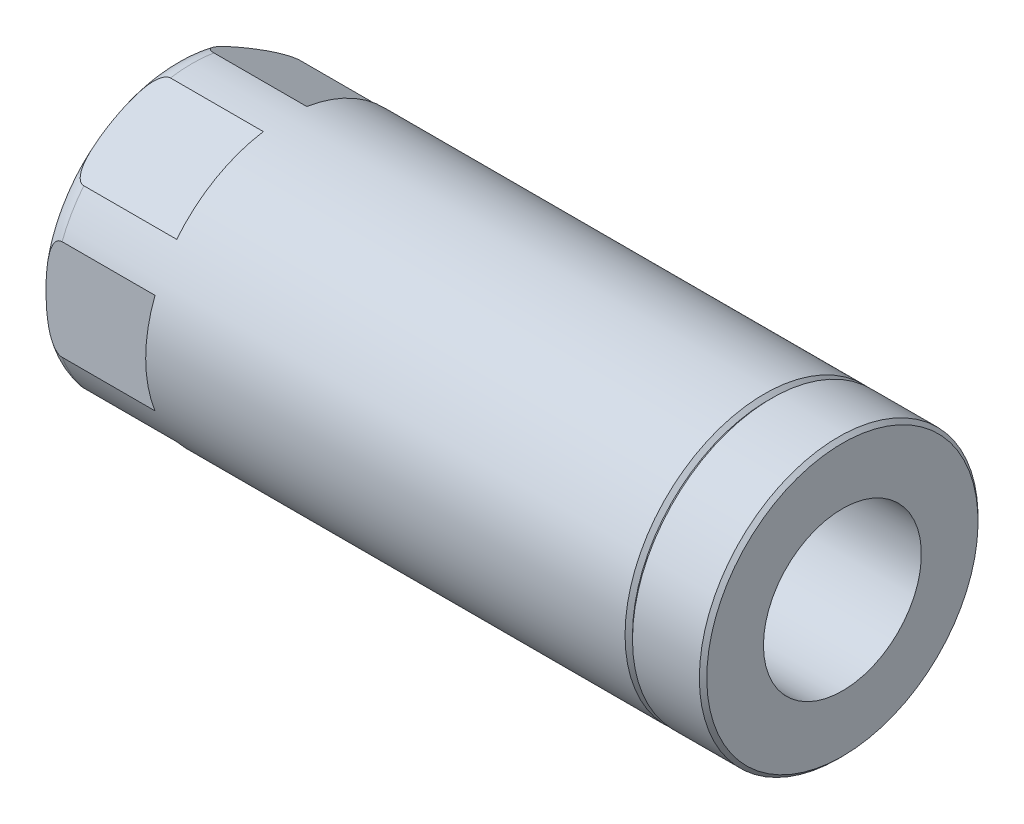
ISO-10303-21;
HEADER;
FILE_DESCRIPTION(('STEP AP214'),'2;1');
FILE_NAME('part.step','',(''),(''),'','','');
FILE_SCHEMA(('AUTOMOTIVE_DESIGN { 1 0 10303 214 1 1 1 1 }'));
ENDSEC;
DATA;
#1=APPLICATION_CONTEXT('core data for automotive mechanical design processes');
#2=APPLICATION_PROTOCOL_DEFINITION('international standard','automotive_design',2000,#1);
#3=PRODUCT_CONTEXT('',#1,'mechanical');
#4=PRODUCT('Part','Part','',(#3));
#5=PRODUCT_RELATED_PRODUCT_CATEGORY('part','',(#4));
#6=PRODUCT_DEFINITION_FORMATION('','',#4);
#7=PRODUCT_DEFINITION_CONTEXT('part definition',#1,'design');
#8=PRODUCT_DEFINITION('design','',#6,#7);
#9=PRODUCT_DEFINITION_SHAPE('','',#8);
#10=(LENGTH_UNIT() NAMED_UNIT(*) SI_UNIT(.MILLI.,.METRE.));
#11=(NAMED_UNIT(*) PLANE_ANGLE_UNIT() SI_UNIT($,.RADIAN.));
#12=(NAMED_UNIT(*) SI_UNIT($,.STERADIAN.) SOLID_ANGLE_UNIT());
#13=UNCERTAINTY_MEASURE_WITH_UNIT(LENGTH_MEASURE(1.E-05),#10,'distance_accuracy_value','');
#14=(GEOMETRIC_REPRESENTATION_CONTEXT(3) GLOBAL_UNCERTAINTY_ASSIGNED_CONTEXT((#13)) GLOBAL_UNIT_ASSIGNED_CONTEXT((#10,
#11,#12)) REPRESENTATION_CONTEXT('',''));
#15=CARTESIAN_POINT('',(0.,0.,0.));
#16=DIRECTION('',(0.,0.,1.));
#17=DIRECTION('',(1.,0.,0.));
#18=AXIS2_PLACEMENT_3D('',#15,#16,#17);
#19=CARTESIAN_POINT('',(36.,0.,0.));
#20=DIRECTION('',(-1.,0.,0.));
#21=DIRECTION('',(0.,0.,1.));
#22=AXIS2_PLACEMENT_3D('',#19,#20,#21);
#23=CYLINDRICAL_SURFACE('',#22,4.25);
#24=CARTESIAN_POINT('',(36.,0.,0.));
#25=DIRECTION('',(-1.,0.,0.));
#26=DIRECTION('',(0.,0.,1.));
#27=AXIS2_PLACEMENT_3D('',#24,#25,#26);
#28=CIRCLE('',#27,4.25);
#29=CARTESIAN_POINT('',(36.,0.,4.25));
#30=VERTEX_POINT('',#29);
#31=EDGE_CURVE('E466',#30,#30,#28,.F.);
#32=ORIENTED_EDGE('',*,*,#31,.T.);
#33=EDGE_LOOP('',(#32));
#34=FACE_BOUND('',#33,.T.);
#35=CARTESIAN_POINT('',(7.99999999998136,0.,0.));
#36=DIRECTION('',(1.,0.,0.));
#37=DIRECTION('',(0.,0.,-1.));
#38=AXIS2_PLACEMENT_3D('',#35,#36,#37);
#39=CIRCLE('',#38,4.2499999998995);
#40=CARTESIAN_POINT('',(7.99999999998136,0.,-4.2499999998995));
#41=VERTEX_POINT('',#40);
#42=EDGE_CURVE('E462',#41,#41,#39,.F.);
#43=ORIENTED_EDGE('',*,*,#42,.T.);
#44=EDGE_LOOP('',(#43));
#45=FACE_BOUND('',#44,.T.);
#46=ADVANCED_FACE('F17',(#34,#45),#23,.F.);
#47=CARTESIAN_POINT('',(36.,4.25,0.));
#48=DIRECTION('',(-1.,0.,0.));
#49=DIRECTION('',(0.,0.,1.));
#50=AXIS2_PLACEMENT_3D('',#47,#48,#49);
#51=PLANE('',#50);
#52=ORIENTED_EDGE('',*,*,#31,.F.);
#53=EDGE_LOOP('',(#52));
#54=FACE_BOUND('',#53,.T.);
#55=CARTESIAN_POINT('',(36.,0.,0.));
#56=DIRECTION('',(-1.,0.,0.));
#57=DIRECTION('',(0.,-1.,0.));
#58=AXIS2_PLACEMENT_3D('',#55,#56,#57);
#59=CIRCLE('',#58,7.3);
#60=CARTESIAN_POINT('',(36.,-7.3,0.));
#61=VERTEX_POINT('',#60);
#62=EDGE_CURVE('E465',#61,#61,#59,.T.);
#63=ORIENTED_EDGE('',*,*,#62,.F.);
#64=EDGE_LOOP('',(#63));
#65=FACE_BOUND('',#64,.T.);
#66=ADVANCED_FACE('F515',(#54,#65),#51,.F.);
#67=CARTESIAN_POINT('',(7.99999999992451,0.,0.));
#68=DIRECTION('',(1.,0.,0.));
#69=DIRECTION('',(0.,0.,-1.));
#70=AXIS2_PLACEMENT_3D('',#67,#68,#69);
#71=CONICAL_SURFACE('',#70,4.24999999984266,0.785398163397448);
#72=CARTESIAN_POINT('',(6.2085,0.,0.));
#73=DIRECTION('',(-1.,0.,0.));
#74=DIRECTION('',(0.,0.,1.));
#75=AXIS2_PLACEMENT_3D('',#72,#73,#74);
#76=CIRCLE('',#75,2.4585);
#77=CARTESIAN_POINT('',(6.2085,0.,2.4585));
#78=VERTEX_POINT('',#77);
#79=EDGE_CURVE('E467',#78,#78,#76,.T.);
#80=ORIENTED_EDGE('',*,*,#79,.T.);
#81=EDGE_LOOP('',(#80));
#82=FACE_BOUND('',#81,.T.);
#83=ORIENTED_EDGE('',*,*,#42,.F.);
#84=EDGE_LOOP('',(#83));
#85=FACE_BOUND('',#84,.T.);
#86=ADVANCED_FACE('F512',(#82,#85),#71,.F.);
#87=CARTESIAN_POINT('',(35.8,0.,0.));
#88=DIRECTION('',(-1.,0.,0.));
#89=DIRECTION('',(0.,-1.,0.));
#90=AXIS2_PLACEMENT_3D('',#87,#88,#89);
#91=CONICAL_SURFACE('',#90,7.5,0.785398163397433);
#92=CARTESIAN_POINT('',(35.8,0.,0.));
#93=DIRECTION('',(-1.,0.,0.));
#94=DIRECTION('',(0.,0.,1.));
#95=AXIS2_PLACEMENT_3D('',#92,#93,#94);
#96=CIRCLE('',#95,7.5);
#97=CARTESIAN_POINT('',(35.8,0.,7.5));
#98=VERTEX_POINT('',#97);
#99=EDGE_CURVE('E470',#98,#98,#96,.T.);
#100=ORIENTED_EDGE('',*,*,#99,.F.);
#101=EDGE_LOOP('',(#100));
#102=FACE_BOUND('',#101,.T.);
#103=ORIENTED_EDGE('',*,*,#62,.T.);
#104=EDGE_LOOP('',(#103));
#105=FACE_BOUND('',#104,.T.);
#106=ADVANCED_FACE('F508',(#102,#105),#91,.T.);
#107=CARTESIAN_POINT('',(36.,0.,0.));
#108=DIRECTION('',(-1.,0.,0.));
#109=DIRECTION('',(0.,0.,1.));
#110=AXIS2_PLACEMENT_3D('',#107,#108,#109);
#111=CYLINDRICAL_SURFACE('',#110,2.4585);
#112=ORIENTED_EDGE('',*,*,#79,.F.);
#113=EDGE_LOOP('',(#112));
#114=FACE_BOUND('',#113,.T.);
#115=CARTESIAN_POINT('',(0.541499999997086,0.,0.));
#116=DIRECTION('',(-1.,0.,0.));
#117=DIRECTION('',(0.,0.,1.));
#118=AXIS2_PLACEMENT_3D('',#115,#116,#117);
#119=CIRCLE('',#118,2.45849999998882);
#120=CARTESIAN_POINT('',(0.541499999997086,0.,2.45849999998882));
#121=VERTEX_POINT('',#120);
#122=EDGE_CURVE('E473',#121,#121,#119,.T.);
#123=ORIENTED_EDGE('',*,*,#122,.T.);
#124=EDGE_LOOP('',(#123));
#125=FACE_BOUND('',#124,.T.);
#126=ADVANCED_FACE('F501',(#114,#125),#111,.F.);
#127=CARTESIAN_POINT('',(36.,0.,0.));
#128=DIRECTION('',(-1.,0.,0.));
#129=DIRECTION('',(0.,0.,1.));
#130=AXIS2_PLACEMENT_3D('',#127,#128,#129);
#131=CYLINDRICAL_SURFACE('',#130,7.5);
#132=CARTESIAN_POINT('',(32.2,0.,0.));
#133=DIRECTION('',(1.,0.,0.));
#134=DIRECTION('',(0.,0.,-1.));
#135=AXIS2_PLACEMENT_3D('',#132,#133,#134);
#136=CIRCLE('',#135,7.5);
#137=CARTESIAN_POINT('',(32.2,0.,-7.5));
#138=VERTEX_POINT('',#137);
#139=EDGE_CURVE('E475',#138,#138,#136,.F.);
#140=ORIENTED_EDGE('',*,*,#139,.F.);
#141=EDGE_LOOP('',(#140));
#142=FACE_BOUND('',#141,.T.);
#143=ORIENTED_EDGE('',*,*,#99,.T.);
#144=EDGE_LOOP('',(#143));
#145=FACE_BOUND('',#144,.T.);
#146=ADVANCED_FACE('F496',(#142,#145),#131,.T.);
#147=CARTESIAN_POINT('',(0.,0.,0.));
#148=DIRECTION('',(-1.,0.,0.));
#149=DIRECTION('',(0.,0.,1.));
#150=AXIS2_PLACEMENT_3D('',#147,#148,#149);
#151=CONICAL_SURFACE('',#150,2.9999999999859,0.785398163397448);
#152=ORIENTED_EDGE('',*,*,#122,.F.);
#153=EDGE_LOOP('',(#152));
#154=FACE_BOUND('',#153,.T.);
#155=CARTESIAN_POINT('',(0.,0.,0.));
#156=DIRECTION('',(-1.,0.,0.));
#157=DIRECTION('',(0.,0.,1.));
#158=AXIS2_PLACEMENT_3D('',#155,#156,#157);
#159=CIRCLE('',#158,2.9999999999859);
#160=CARTESIAN_POINT('',(0.,0.,2.9999999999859));
#161=VERTEX_POINT('',#160);
#162=EDGE_CURVE('E152',#161,#161,#159,.T.);
#163=ORIENTED_EDGE('',*,*,#162,.T.);
#164=EDGE_LOOP('',(#163));
#165=FACE_BOUND('',#164,.T.);
#166=ADVANCED_FACE('F492',(#154,#165),#151,.F.);
#167=CARTESIAN_POINT('',(32.2,0.,0.));
#168=DIRECTION('',(1.,0.,0.));
#169=DIRECTION('',(0.,0.,-1.));
#170=AXIS2_PLACEMENT_3D('',#167,#168,#169);
#171=CONICAL_SURFACE('',#170,7.5,0.785398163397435);
#172=ORIENTED_EDGE('',*,*,#139,.T.);
#173=EDGE_LOOP('',(#172));
#174=FACE_BOUND('',#173,.T.);
#175=CARTESIAN_POINT('',(32.,0.,0.));
#176=DIRECTION('',(-1.,0.,0.));
#177=DIRECTION('',(0.,0.,1.));
#178=AXIS2_PLACEMENT_3D('',#175,#176,#177);
#179=CIRCLE('',#178,7.3);
#180=CARTESIAN_POINT('',(32.,0.,7.3));
#181=VERTEX_POINT('',#180);
#182=EDGE_CURVE('E203',#181,#181,#179,.T.);
#183=ORIENTED_EDGE('',*,*,#182,.F.);
#184=EDGE_LOOP('',(#183));
#185=FACE_BOUND('',#184,.T.);
#186=ADVANCED_FACE('F185',(#174,#185),#171,.T.);
#187=CARTESIAN_POINT('',(0.,6.5,0.));
#188=DIRECTION('',(1.,0.,0.));
#189=DIRECTION('',(0.,0.,-1.));
#190=AXIS2_PLACEMENT_3D('',#187,#188,#189);
#191=PLANE('',#190);
#192=CARTESIAN_POINT('',(0.,0.,0.));
#193=DIRECTION('',(1.,0.,0.));
#194=DIRECTION('',(0.,0.,1.));
#195=AXIS2_PLACEMENT_3D('',#192,#193,#194);
#196=CIRCLE('',#195,6.5);
#197=CARTESIAN_POINT('',(0.,0.,6.5));
#198=VERTEX_POINT('',#197);
#199=CARTESIAN_POINT('',(0.,0.,-6.5));
#200=VERTEX_POINT('',#199);
#201=EDGE_CURVE('E167',#198,#200,#196,.T.);
#202=ORIENTED_EDGE('',*,*,#201,.F.);
#203=CARTESIAN_POINT('',(0.,0.,0.));
#204=DIRECTION('',(1.,0.,0.));
#205=DIRECTION('',(0.,0.,-1.));
#206=AXIS2_PLACEMENT_3D('',#203,#204,#205);
#207=CIRCLE('',#206,6.5);
#208=EDGE_CURVE('E199',#200,#198,#207,.T.);
#209=ORIENTED_EDGE('',*,*,#208,.F.);
#210=EDGE_LOOP('',(#202,#209));
#211=FACE_BOUND('',#210,.T.);
#212=ORIENTED_EDGE('',*,*,#162,.F.);
#213=EDGE_LOOP('',(#212));
#214=FACE_BOUND('',#213,.T.);
#215=ADVANCED_FACE('F174',(#211,#214),#191,.F.);
#216=CARTESIAN_POINT('',(6.,0.,0.));
#217=DIRECTION('',(1.,0.,0.));
#218=DIRECTION('',(0.,0.,-1.));
#219=AXIS2_PLACEMENT_3D('',#216,#217,#218);
#220=PLANE('',#219);
#221=CARTESIAN_POINT('',(6.,0.,0.));
#222=DIRECTION('',(-1.,0.,0.));
#223=DIRECTION('',(0.,0.,1.));
#224=AXIS2_PLACEMENT_3D('',#221,#222,#223);
#225=CIRCLE('',#224,7.5);
#226=CARTESIAN_POINT('',(6.,-4.71588662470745,5.8318447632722));
#227=VERTEX_POINT('',#226);
#228=CARTESIAN_POINT('',(6.,-7.4084690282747,1.16815523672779));
#229=VERTEX_POINT('',#228);
#230=EDGE_CURVE('E150',#227,#229,#225,.F.);
#231=ORIENTED_EDGE('',*,*,#230,.F.);
#232=DIRECTION('',(0.,0.5,0.866025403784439));
#233=VECTOR('',#232,1.);
#234=CARTESIAN_POINT('',(6.,-4.04145188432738,7.));
#235=LINE('',#234,#233);
#236=EDGE_CURVE('E143',#227,#229,#235,.F.);
#237=ORIENTED_EDGE('',*,*,#236,.T.);
#238=EDGE_LOOP('',(#231,#237));
#239=FACE_BOUND('',#238,.T.);
#240=ADVANCED_FACE('F184',(#239),#220,.F.);
#241=CARTESIAN_POINT('',(6.,-4.04145188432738,7.));
#242=DIRECTION('',(0.,0.866025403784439,-0.5));
#243=DIRECTION('',(0.,0.5,0.866025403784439));
#244=AXIS2_PLACEMENT_3D('',#241,#242,#243);
#245=PLANE('',#244);
#246=DIRECTION('',(-1.,0.,0.));
#247=VECTOR('',#246,1.);
#248=CARTESIAN_POINT('',(36.,-4.71588662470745,5.8318447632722));
#249=LINE('',#248,#247);
#250=CARTESIAN_POINT('',(1.,-4.71588662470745,5.8318447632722));
#251=VERTEX_POINT('',#250);
#252=EDGE_CURVE('E153',#251,#227,#249,.F.);
#253=ORIENTED_EDGE('',*,*,#252,.F.);
#254=CARTESIAN_POINT('',(1.00000000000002,-7.4084690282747,1.1681552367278));
#255=CARTESIAN_POINT('',(0.988799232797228,-7.40847068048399,1.16815237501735));
#256=CARTESIAN_POINT('',(0.977604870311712,-7.40820674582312,1.16860952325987));
#257=CARTESIAN_POINT('',(0.955324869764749,-7.40716421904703,1.17041523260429));
#258=CARTESIAN_POINT('',(0.944239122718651,-7.40638621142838,1.17176278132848));
#259=CARTESIAN_POINT('',(0.911519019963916,-7.40332998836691,1.1770563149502));
#260=CARTESIAN_POINT('',(0.890144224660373,-7.40032867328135,1.18225474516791));
#261=CARTESIAN_POINT('',(0.844142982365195,-7.39182550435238,1.19698266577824));
#262=CARTESIAN_POINT('',(0.819820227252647,-7.38592181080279,1.20720816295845));
#263=CARTESIAN_POINT('',(0.773333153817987,-7.3722144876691,1.23094994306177));
#264=CARTESIAN_POINT('',(0.751179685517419,-7.36440192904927,1.24448169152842));
#265=CARTESIAN_POINT('',(0.697078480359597,-7.34254059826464,1.28234662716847));
#266=CARTESIAN_POINT('',(0.666781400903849,-7.32748167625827,1.30842944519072));
#267=CARTESIAN_POINT('',(0.610957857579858,-7.29533035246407,1.36411717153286));
#268=CARTESIAN_POINT('',(0.585440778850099,-7.27823405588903,1.39372882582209));
#269=CARTESIAN_POINT('',(0.538470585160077,-7.24289259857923,1.4549420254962));
#270=CARTESIAN_POINT('',(0.516990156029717,-7.2246563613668,1.48652811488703));
#271=CARTESIAN_POINT('',(0.477148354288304,-7.18734173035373,1.55115895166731));
#272=CARTESIAN_POINT('',(0.458790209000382,-7.16826249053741,1.5842051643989));
#273=CARTESIAN_POINT('',(0.424624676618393,-7.12949680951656,1.6513492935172));
#274=CARTESIAN_POINT('',(0.40882310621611,-7.10980910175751,1.68544940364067));
#275=CARTESIAN_POINT('',(0.379405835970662,-7.0700456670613,1.75432169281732));
#276=CARTESIAN_POINT('',(0.36578907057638,-7.04997013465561,1.78909353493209));
#277=CARTESIAN_POINT('',(0.324670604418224,-6.98453529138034,1.902430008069));
#278=CARTESIAN_POINT('',(0.300816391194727,-6.93860314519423,1.98198681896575));
#279=CARTESIAN_POINT('',(0.259589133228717,-6.845959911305,2.14244960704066));
#280=CARTESIAN_POINT('',(0.24222958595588,-6.79924740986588,2.22335803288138));
#281=CARTESIAN_POINT('',(0.212395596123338,-6.70539133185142,2.38592152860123));
#282=CARTESIAN_POINT('',(0.199926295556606,-6.65824735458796,2.46757729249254));
#283=CARTESIAN_POINT('',(0.17872182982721,-6.56348745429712,2.63170625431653));
#284=CARTESIAN_POINT('',(0.170008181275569,-6.51587037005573,2.71418146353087));
#285=CARTESIAN_POINT('',(0.15566147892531,-6.42058538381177,2.87921990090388));
#286=CARTESIAN_POINT('',(0.1500244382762,-6.37291762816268,2.96178287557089));
#287=CARTESIAN_POINT('',(0.141329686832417,-6.27754207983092,3.12697817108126));
#288=CARTESIAN_POINT('',(0.138271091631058,-6.22983430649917,3.20961045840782));
#289=CARTESIAN_POINT('',(0.133508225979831,-6.11091781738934,3.41557985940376));
#290=CARTESIAN_POINT('',(0.133210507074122,-6.03969415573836,3.53894286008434));
#291=CARTESIAN_POINT('',(0.137644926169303,-5.89724505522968,3.78567193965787));
#292=CARTESIAN_POINT('',(0.142380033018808,-5.82601964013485,3.9090379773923));
#293=CARTESIAN_POINT('',(0.157756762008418,-5.68414906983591,4.15476501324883));
#294=CARTESIAN_POINT('',(0.16836197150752,-5.61350303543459,4.27712753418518));
#295=CARTESIAN_POINT('',(0.190248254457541,-5.50786686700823,4.46009474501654));
#296=CARTESIAN_POINT('',(0.198536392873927,-5.47272177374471,4.52096783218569));
#297=CARTESIAN_POINT('',(0.217527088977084,-5.40259597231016,4.64242928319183));
#298=CARTESIAN_POINT('',(0.228229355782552,-5.36761524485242,4.70301768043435));
#299=CARTESIAN_POINT('',(0.253385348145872,-5.29561289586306,4.82772940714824));
#300=CARTESIAN_POINT('',(0.268039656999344,-5.25860851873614,4.89182286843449));
#301=CARTESIAN_POINT('',(0.301641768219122,-5.18495954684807,5.01938662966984));
#302=CARTESIAN_POINT('',(0.32060198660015,-5.14831631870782,5.08285456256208));
#303=CARTESIAN_POINT('',(0.354983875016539,-5.09103788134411,5.18206372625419));
#304=CARTESIAN_POINT('',(0.368561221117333,-5.0701264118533,5.21828345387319));
#305=CARTESIAN_POINT('',(0.397951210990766,-5.02870248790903,5.29003179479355));
#306=CARTESIAN_POINT('',(0.413763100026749,-5.00818990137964,5.3255606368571));
#307=CARTESIAN_POINT('',(0.447998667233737,-4.96781298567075,5.39549550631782));
#308=CARTESIAN_POINT('',(0.466411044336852,-4.9479462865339,5.42990563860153));
#309=CARTESIAN_POINT('',(0.506482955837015,-4.90902856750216,5.49731310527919));
#310=CARTESIAN_POINT('',(0.528142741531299,-4.88997761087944,5.53031033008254));
#311=CARTESIAN_POINT('',(0.569797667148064,-4.85755467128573,5.58646850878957));
#312=CARTESIAN_POINT('',(0.588950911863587,-4.84391461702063,5.61009377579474));
#313=CARTESIAN_POINT('',(0.629959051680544,-4.81770589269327,5.65548861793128));
#314=CARTESIAN_POINT('',(0.651809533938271,-4.80513552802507,5.67726112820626));
#315=CARTESIAN_POINT('',(0.698984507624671,-4.78136907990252,5.71842582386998));
#316=CARTESIAN_POINT('',(0.724352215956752,-4.77019401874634,5.7377815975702));
#317=CARTESIAN_POINT('',(0.778629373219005,-4.75023628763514,5.77234940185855));
#318=CARTESIAN_POINT('',(0.807527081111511,-4.74144598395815,5.78757465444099));
#319=CARTESIAN_POINT('',(0.857771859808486,-4.72981901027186,5.80771316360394));
#320=CARTESIAN_POINT('',(0.878185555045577,-4.72597601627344,5.81436942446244));
#321=CARTESIAN_POINT('',(0.919994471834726,-4.72004816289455,5.82463676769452));
#322=CARTESIAN_POINT('',(0.941386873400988,-4.71795855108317,5.8282560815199));
#323=CARTESIAN_POINT('',(0.969106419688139,-4.71652468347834,5.8307396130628));
#324=CARTESIAN_POINT('',(0.975276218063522,-4.71628564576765,5.83115363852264));
#325=CARTESIAN_POINT('',(0.987629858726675,-4.71596676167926,5.83170596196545));
#326=CARTESIAN_POINT('',(0.993813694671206,-4.71588685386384,5.83184436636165));
#327=CARTESIAN_POINT('',(0.999999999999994,-4.71588662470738,5.83184476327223));
#328=B_SPLINE_CURVE_WITH_KNOTS('',3,(#254,#255,#256,#257,#258,#259,#260,#261,#262,#263,#264,
#265,#266,#267,#268,#269,#270,#271,#272,#273,#274,#275,#276,#277,#278,#279,#280,#281,#282,#283,
#284,#285,#286,#287,#288,#289,#290,#291,#292,#293,#294,#295,#296,#297,#298,#299,#300,#301,#302,
#303,#304,#305,#306,#307,#308,#309,#310,#311,#312,#313,#314,#315,#316,#317,#318,#319,#320,#321,
#322,#323,#324,#325,#326,#327),.UNSPECIFIED.,.F.,.F.,(4,2,2,2,2,2,2,2,2,2,2,2,2,2,2,2,2,2,2,2,2,
2,2,2,2,2,2,2,2,2,2,2,2,2,2,2,4),(0.,0.0335780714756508,0.067118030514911,0.133377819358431,
0.214046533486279,0.295100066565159,0.422540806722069,0.550229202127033,0.677019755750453,
0.803940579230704,0.931146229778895,1.05828965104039,1.34262726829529,1.62755256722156,
1.91277666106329,2.19961379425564,2.48607833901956,2.77244458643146,3.19969305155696,
3.62719368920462,4.05207175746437,4.26437145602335,4.47664558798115,4.70289408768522,
4.9298034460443,5.06166900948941,5.19349014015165,5.32475509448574,5.4560302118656,
5.55589257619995,5.6555936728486,5.75665111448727,5.85738114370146,5.92257044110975,
5.98758247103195,6.00614159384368,6.02469354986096),.UNSPECIFIED.);
#329=CARTESIAN_POINT('',(1.00000000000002,-7.4084690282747,1.16815523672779));
#330=VERTEX_POINT('',#329);
#331=EDGE_CURVE('E120',#330,#251,#328,.T.);
#332=ORIENTED_EDGE('',*,*,#331,.F.);
#333=DIRECTION('',(-1.,0.,0.));
#334=VECTOR('',#333,1.);
#335=CARTESIAN_POINT('',(36.,-7.4084690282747,1.16815523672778));
#336=LINE('',#335,#334);
#337=EDGE_CURVE('E147',#229,#330,#336,.T.);
#338=ORIENTED_EDGE('',*,*,#337,.F.);
#339=ORIENTED_EDGE('',*,*,#236,.F.);
#340=EDGE_LOOP('',(#253,#332,#338,#339));
#341=FACE_BOUND('',#340,.T.);
#342=ADVANCED_FACE('F317',(#341),#245,.F.);
#343=CARTESIAN_POINT('',(6.,0.,0.));
#344=DIRECTION('',(1.,0.,0.));
#345=DIRECTION('',(0.,0.,-1.));
#346=AXIS2_PLACEMENT_3D('',#343,#344,#345);
#347=PLANE('',#346);
#348=CARTESIAN_POINT('',(6.,0.,0.));
#349=DIRECTION('',(-1.,0.,0.));
#350=DIRECTION('',(0.,0.,1.));
#351=AXIS2_PLACEMENT_3D('',#348,#349,#350);
#352=CIRCLE('',#351,7.5);
#353=CARTESIAN_POINT('',(6.,-7.4084690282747,-1.1681552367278));
#354=VERTEX_POINT('',#353);
#355=CARTESIAN_POINT('',(6.,-4.71588662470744,-5.8318447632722));
#356=VERTEX_POINT('',#355);
#357=EDGE_CURVE('E136',#354,#356,#352,.F.);
#358=ORIENTED_EDGE('',*,*,#357,.F.);
#359=DIRECTION('',(0.,-0.5,0.866025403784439));
#360=VECTOR('',#359,1.);
#361=CARTESIAN_POINT('',(6.,-8.08290376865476,0.));
#362=LINE('',#361,#360);
#363=EDGE_CURVE('E121',#354,#356,#362,.F.);
#364=ORIENTED_EDGE('',*,*,#363,.T.);
#365=EDGE_LOOP('',(#358,#364));
#366=FACE_BOUND('',#365,.T.);
#367=ADVANCED_FACE('F325',(#366),#347,.F.);
#368=CARTESIAN_POINT('',(6.,-8.08290376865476,0.));
#369=DIRECTION('',(0.,0.866025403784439,0.5));
#370=DIRECTION('',(0.,-0.5,0.866025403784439));
#371=AXIS2_PLACEMENT_3D('',#368,#369,#370);
#372=PLANE('',#371);
#373=DIRECTION('',(-1.,0.,0.));
#374=VECTOR('',#373,1.);
#375=CARTESIAN_POINT('',(36.,-7.40846902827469,-1.1681552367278));
#376=LINE('',#375,#374);
#377=CARTESIAN_POINT('',(1.00000000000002,-7.4084690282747,-1.1681552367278));
#378=VERTEX_POINT('',#377);
#379=EDGE_CURVE('E116',#378,#354,#376,.F.);
#380=ORIENTED_EDGE('',*,*,#379,.F.);
#381=CARTESIAN_POINT('',(1.00000000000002,-4.71588662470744,-5.8318447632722));
#382=CARTESIAN_POINT('',(0.988799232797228,-4.71588497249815,-5.83184762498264));
#383=CARTESIAN_POINT('',(0.977604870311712,-4.71614890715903,-5.83139047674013));
#384=CARTESIAN_POINT('',(0.955324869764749,-4.71719143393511,-5.82958476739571));
#385=CARTESIAN_POINT('',(0.94423912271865,-4.71796944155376,-5.82823721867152));
#386=CARTESIAN_POINT('',(0.911519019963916,-4.72102566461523,-5.8229436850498));
#387=CARTESIAN_POINT('',(0.890144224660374,-4.72402697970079,-5.81774525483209));
#388=CARTESIAN_POINT('',(0.844142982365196,-4.73253014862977,-5.80301733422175));
#389=CARTESIAN_POINT('',(0.819820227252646,-4.73843384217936,-5.79279183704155));
#390=CARTESIAN_POINT('',(0.773333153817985,-4.75214116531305,-5.76905005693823));
#391=CARTESIAN_POINT('',(0.751179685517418,-4.75995372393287,-5.75551830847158));
#392=CARTESIAN_POINT('',(0.697078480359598,-4.7818150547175,-5.71765337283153));
#393=CARTESIAN_POINT('',(0.666781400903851,-4.79687397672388,-5.69157055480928));
#394=CARTESIAN_POINT('',(0.610957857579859,-4.82902530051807,-5.63588282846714));
#395=CARTESIAN_POINT('',(0.585440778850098,-4.8461215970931,-5.6062711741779));
#396=CARTESIAN_POINT('',(0.538470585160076,-4.88146305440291,-5.5450579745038));
#397=CARTESIAN_POINT('',(0.516990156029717,-4.89969929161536,-5.51347188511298));
#398=CARTESIAN_POINT('',(0.477148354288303,-4.9370139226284,-5.44884104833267));
#399=CARTESIAN_POINT('',(0.45879020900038,-4.95609316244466,-5.41579483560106));
#400=CARTESIAN_POINT('',(0.42462467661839,-4.99485884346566,-5.34865070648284));
#401=CARTESIAN_POINT('',(0.408823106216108,-5.01454655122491,-5.31455059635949));
#402=CARTESIAN_POINT('',(0.379405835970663,-5.05430998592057,-5.24567830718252));
#403=CARTESIAN_POINT('',(0.365789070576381,-5.07438551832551,-5.21090646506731));
#404=CARTESIAN_POINT('',(0.324670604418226,-5.13982036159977,-5.09756999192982));
#405=CARTESIAN_POINT('',(0.300816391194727,-5.18575250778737,-5.01801318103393));
#406=CARTESIAN_POINT('',(0.259589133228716,-5.2783957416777,-4.85755039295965));
#407=CARTESIAN_POINT('',(0.242229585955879,-5.32510824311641,-4.77664196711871));
#408=CARTESIAN_POINT('',(0.212395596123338,-5.41896432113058,-4.61407847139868));
#409=CARTESIAN_POINT('',(0.199926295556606,-5.46610829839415,-4.53242270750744));
#410=CARTESIAN_POINT('',(0.17872182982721,-5.56086819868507,-4.36829374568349));
#411=CARTESIAN_POINT('',(0.170008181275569,-5.60848528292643,-4.28581853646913));
#412=CARTESIAN_POINT('',(0.15566147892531,-5.70377026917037,-4.12078009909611));
#413=CARTESIAN_POINT('',(0.1500244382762,-5.75143802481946,-4.0382171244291));
#414=CARTESIAN_POINT('',(0.141329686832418,-5.84681357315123,-3.87302182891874));
#415=CARTESIAN_POINT('',(0.138271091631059,-5.89452134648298,-3.79038954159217));
#416=CARTESIAN_POINT('',(0.133508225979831,-6.01343783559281,-3.58442014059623));
#417=CARTESIAN_POINT('',(0.133210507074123,-6.08466149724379,-3.46105713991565));
#418=CARTESIAN_POINT('',(0.137644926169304,-6.22711059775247,-3.21432806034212));
#419=CARTESIAN_POINT('',(0.14238003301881,-6.2983360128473,-3.09096202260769));
#420=CARTESIAN_POINT('',(0.157756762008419,-6.44020658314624,-2.84523498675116));
#421=CARTESIAN_POINT('',(0.168361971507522,-6.51085261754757,-2.7228724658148));
#422=CARTESIAN_POINT('',(0.190248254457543,-6.61648878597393,-2.53990525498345));
#423=CARTESIAN_POINT('',(0.19853639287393,-6.65163387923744,-2.47903216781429));
#424=CARTESIAN_POINT('',(0.217527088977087,-6.721759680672,-2.35757071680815));
#425=CARTESIAN_POINT('',(0.228229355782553,-6.75674040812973,-2.29698231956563));
#426=CARTESIAN_POINT('',(0.253385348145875,-6.8287427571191,-2.17227059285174));
#427=CARTESIAN_POINT('',(0.268039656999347,-6.86574713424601,-2.1081771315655));
#428=CARTESIAN_POINT('',(0.301641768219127,-6.93939610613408,-1.98061337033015));
#429=CARTESIAN_POINT('',(0.320601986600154,-6.97603933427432,-1.9171454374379));
#430=CARTESIAN_POINT('',(0.354983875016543,-7.03331777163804,-1.8179362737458));
#431=CARTESIAN_POINT('',(0.368561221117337,-7.05422924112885,-1.78171654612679));
#432=CARTESIAN_POINT('',(0.39795121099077,-7.09565316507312,-1.70996820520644));
#433=CARTESIAN_POINT('',(0.413763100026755,-7.11616575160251,-1.6744393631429));
#434=CARTESIAN_POINT('',(0.447998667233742,-7.1565426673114,-1.60450449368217));
#435=CARTESIAN_POINT('',(0.466411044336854,-7.17640936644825,-1.57009436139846));
#436=CARTESIAN_POINT('',(0.506482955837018,-7.21532708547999,-1.5026868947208));
#437=CARTESIAN_POINT('',(0.528142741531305,-7.2343780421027,-1.46968966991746));
#438=CARTESIAN_POINT('',(0.569797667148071,-7.26680098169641,-1.41353149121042));
#439=CARTESIAN_POINT('',(0.588950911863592,-7.28044103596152,-1.38990622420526));
#440=CARTESIAN_POINT('',(0.629959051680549,-7.30664976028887,-1.34451138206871));
#441=CARTESIAN_POINT('',(0.651809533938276,-7.31922012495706,-1.32273887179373));
#442=CARTESIAN_POINT('',(0.698984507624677,-7.34298657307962,-1.28157417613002));
#443=CARTESIAN_POINT('',(0.724352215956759,-7.35416163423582,-1.26221840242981));
#444=CARTESIAN_POINT('',(0.778629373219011,-7.37411936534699,-1.22765059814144));
#445=CARTESIAN_POINT('',(0.807527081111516,-7.38290966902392,-1.21242534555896));
#446=CARTESIAN_POINT('',(0.857771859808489,-7.39453664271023,-1.19228683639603));
#447=CARTESIAN_POINT('',(0.87818555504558,-7.3983796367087,-1.18563057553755));
#448=CARTESIAN_POINT('',(0.919994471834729,-7.40430749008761,-1.17536323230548));
#449=CARTESIAN_POINT('',(0.941386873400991,-7.40639710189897,-1.17174391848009));
#450=CARTESIAN_POINT('',(0.969106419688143,-7.4078309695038,-1.1692603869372));
#451=CARTESIAN_POINT('',(0.975276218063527,-7.4080700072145,-1.16884636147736));
#452=CARTESIAN_POINT('',(0.987629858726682,-7.40838889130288,-1.16829403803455));
#453=CARTESIAN_POINT('',(0.993813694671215,-7.40846879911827,-1.16815563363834));
#454=CARTESIAN_POINT('',(1.,-7.40846902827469,-1.16815523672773));
#455=B_SPLINE_CURVE_WITH_KNOTS('',3,(#381,#382,#383,#384,#385,#386,#387,#388,#389,#390,#391,
#392,#393,#394,#395,#396,#397,#398,#399,#400,#401,#402,#403,#404,#405,#406,#407,#408,#409,#410,
#411,#412,#413,#414,#415,#416,#417,#418,#419,#420,#421,#422,#423,#424,#425,#426,#427,#428,#429,
#430,#431,#432,#433,#434,#435,#436,#437,#438,#439,#440,#441,#442,#443,#444,#445,#446,#447,#448,
#449,#450,#451,#452,#453,#454),.UNSPECIFIED.,.F.,.F.,(4,2,2,2,2,2,2,2,2,2,2,2,2,2,2,2,2,2,2,2,2,
2,2,2,2,2,2,2,2,2,2,2,2,2,2,2,4),(0.,0.0335780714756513,0.0671180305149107,0.133377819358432,
0.21404653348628,0.295100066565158,0.422540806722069,0.550229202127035,0.677019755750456,
0.803940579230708,0.931146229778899,1.05828965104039,1.34262726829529,1.62755256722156,
1.9127766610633,2.19961379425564,2.48607833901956,2.77244458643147,3.19969305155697,
3.62719368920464,4.05207175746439,4.26437145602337,4.47664558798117,4.70289408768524,
4.92980344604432,5.06166900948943,5.19349014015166,5.32475509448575,5.4560302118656,
5.55589257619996,5.65559367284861,5.75665111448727,5.85738114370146,5.92257044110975,
5.98758247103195,6.00614159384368,6.02469354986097),.UNSPECIFIED.);
#456=CARTESIAN_POINT('',(1.00000000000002,-4.71588662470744,-5.8318447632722));
#457=VERTEX_POINT('',#456);
#458=EDGE_CURVE('E109',#457,#378,#455,.T.);
#459=ORIENTED_EDGE('',*,*,#458,.F.);
#460=DIRECTION('',(-1.,0.,0.));
#461=VECTOR('',#460,1.);
#462=CARTESIAN_POINT('',(36.,-4.71588662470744,-5.83184476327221));
#463=LINE('',#462,#461);
#464=EDGE_CURVE('E113',#356,#457,#463,.T.);
#465=ORIENTED_EDGE('',*,*,#464,.F.);
#466=ORIENTED_EDGE('',*,*,#363,.F.);
#467=EDGE_LOOP('',(#380,#459,#465,#466));
#468=FACE_BOUND('',#467,.T.);
#469=ADVANCED_FACE('F111',(#468),#372,.F.);
#470=CARTESIAN_POINT('',(31.8,0.,0.));
#471=DIRECTION('',(-1.,0.,0.));
#472=DIRECTION('',(0.,0.,1.));
#473=AXIS2_PLACEMENT_3D('',#470,#471,#472);
#474=CONICAL_SURFACE('',#473,7.5,0.785398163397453);
#475=CARTESIAN_POINT('',(31.8,0.,0.));
#476=DIRECTION('',(-1.,0.,0.));
#477=DIRECTION('',(0.,0.,1.));
#478=AXIS2_PLACEMENT_3D('',#475,#476,#477);
#479=CIRCLE('',#478,7.5);
#480=CARTESIAN_POINT('',(31.8,0.,7.5));
#481=VERTEX_POINT('',#480);
#482=EDGE_CURVE('E259',#481,#481,#479,.T.);
#483=ORIENTED_EDGE('',*,*,#482,.F.);
#484=EDGE_LOOP('',(#483));
#485=FACE_BOUND('',#484,.T.);
#486=ORIENTED_EDGE('',*,*,#182,.T.);
#487=EDGE_LOOP('',(#486));
#488=FACE_BOUND('',#487,.T.);
#489=ADVANCED_FACE('F321',(#485,#488),#474,.T.);
#490=CARTESIAN_POINT('',(6.,0.,0.));
#491=DIRECTION('',(1.,0.,0.));
#492=DIRECTION('',(0.,0.,-1.));
#493=AXIS2_PLACEMENT_3D('',#490,#491,#492);
#494=PLANE('',#493);
#495=CARTESIAN_POINT('',(6.,0.,0.));
#496=DIRECTION('',(-1.,0.,0.));
#497=DIRECTION('',(0.,0.,1.));
#498=AXIS2_PLACEMENT_3D('',#495,#496,#497);
#499=CIRCLE('',#498,7.5);
#500=CARTESIAN_POINT('',(6.,-2.69258240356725,-7.));
#501=VERTEX_POINT('',#500);
#502=CARTESIAN_POINT('',(6.,2.69258240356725,-7.));
#503=VERTEX_POINT('',#502);
#504=EDGE_CURVE('E257',#501,#503,#499,.F.);
#505=ORIENTED_EDGE('',*,*,#504,.F.);
#506=DIRECTION('',(0.,1.,0.));
#507=VECTOR('',#506,1.);
#508=CARTESIAN_POINT('',(6.,-4.04145188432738,-7.));
#509=LINE('',#508,#507);
#510=EDGE_CURVE('E247',#501,#503,#509,.T.);
#511=ORIENTED_EDGE('',*,*,#510,.T.);
#512=EDGE_LOOP('',(#505,#511));
#513=FACE_BOUND('',#512,.T.);
#514=ADVANCED_FACE('F268',(#513),#494,.F.);
#515=CARTESIAN_POINT('',(6.,-4.04145188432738,-7.));
#516=DIRECTION('',(0.,0.,1.));
#517=DIRECTION('',(1.,0.,0.));
#518=AXIS2_PLACEMENT_3D('',#515,#516,#517);
#519=PLANE('',#518);
#520=DIRECTION('',(-1.,0.,0.));
#521=VECTOR('',#520,1.);
#522=CARTESIAN_POINT('',(36.,-2.69258240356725,-7.));
#523=LINE('',#522,#521);
#524=CARTESIAN_POINT('',(1.00000000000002,-2.69258240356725,-7.));
#525=VERTEX_POINT('',#524);
#526=EDGE_CURVE('E131',#525,#501,#523,.F.);
#527=ORIENTED_EDGE('',*,*,#526,.F.);
#528=CARTESIAN_POINT('',(0.999999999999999,2.69258240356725,-7.));
#529=CARTESIAN_POINT('',(0.988799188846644,2.69258570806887,-7.));
#530=CARTESIAN_POINT('',(0.977604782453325,2.69205783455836,-7.));
#531=CARTESIAN_POINT('',(0.955324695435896,2.68997276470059,-7.));
#532=CARTESIAN_POINT('',(0.944238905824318,2.68841673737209,-7.));
#533=CARTESIAN_POINT('',(0.911518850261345,2.68230427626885,-7.));
#534=CARTESIAN_POINT('',(0.890144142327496,2.67630166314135,-7.));
#535=CARTESIAN_POINT('',(0.84414319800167,2.65929543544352,-7.));
#536=CARTESIAN_POINT('',(0.819820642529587,2.64748817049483,-7.));
#537=CARTESIAN_POINT('',(0.773333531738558,2.62007358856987,-7.));
#538=CARTESIAN_POINT('',(0.751179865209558,2.60444834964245,-7.));
#539=CARTESIAN_POINT('',(0.697077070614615,2.56072440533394,-7.00000000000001));
#540=CARTESIAN_POINT('',(0.66677881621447,2.53060513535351,-7.));
#541=CARTESIAN_POINT('',(0.610955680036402,2.46630212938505,-7.));
#542=CARTESIAN_POINT('',(0.585439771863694,2.43211094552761,-6.99999999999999));
#543=CARTESIAN_POINT('',(0.538476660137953,2.36143868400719,-7.));
#544=CARTESIAN_POINT('',(0.517001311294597,2.32497599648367,-7.00000000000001));
#545=CARTESIAN_POINT('',(0.477168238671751,2.25036702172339,-6.99999999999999));
#546=CARTESIAN_POINT('',(0.458813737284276,2.21221904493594,-6.99999999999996));
#547=CARTESIAN_POINT('',(0.424645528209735,2.13468896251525,-7.00000000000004));
#548=CARTESIAN_POINT('',(0.408838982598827,2.09530373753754,-7.00000000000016));
#549=CARTESIAN_POINT('',(0.37941295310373,2.0157566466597,-6.99999999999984));
#550=CARTESIAN_POINT('',(0.365792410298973,1.97559516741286,-6.9999999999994));
#551=CARTESIAN_POINT('',(0.324610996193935,1.84452538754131,-6.99999999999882));
#552=CARTESIAN_POINT('',(0.30071611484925,1.75246560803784,-6.99999999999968));
#553=CARTESIAN_POINT('',(0.259430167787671,1.5667839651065,-7.00000000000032));
#554=CARTESIAN_POINT('',(0.242052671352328,1.47315926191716,-7.00000000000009));
#555=CARTESIAN_POINT('',(0.212198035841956,1.28504904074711,-6.99999999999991));
#556=CARTESIAN_POINT('',(0.199725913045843,1.19056274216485,-6.99999999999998));
#557=CARTESIAN_POINT('',(0.178570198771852,1.00104531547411,-7.00000000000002));
#558=CARTESIAN_POINT('',(0.169892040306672,0.906013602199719,-7.00000000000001));
#559=CARTESIAN_POINT('',(0.15560165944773,0.715847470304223,-6.99999999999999));
#560=CARTESIAN_POINT('',(0.149985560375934,0.620713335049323,-7.));
#561=CARTESIAN_POINT('',(0.141316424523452,0.430350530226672,-7.));
#562=CARTESIAN_POINT('',(0.138262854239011,0.335121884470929,-7.));
#563=CARTESIAN_POINT('',(0.135561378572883,0.199911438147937,-7.));
#564=CARTESIAN_POINT('',(0.134965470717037,0.159946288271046,-7.));
#565=CARTESIAN_POINT('',(0.134172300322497,0.0799876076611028,-7.));
#566=CARTESIAN_POINT('',(0.133975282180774,0.0399940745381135,-7.));
#567=CARTESIAN_POINT('',(0.133972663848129,-0.112663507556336,-7.));
#568=CARTESIAN_POINT('',(0.135528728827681,-0.225331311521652,-7.));
#569=CARTESIAN_POINT('',(0.141938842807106,-0.450605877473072,-7.));
#570=CARTESIAN_POINT('',(0.146793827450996,-0.563212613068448,-7.00000000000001));
#571=CARTESIAN_POINT('',(0.160407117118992,-0.788434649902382,-6.99999999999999));
#572=CARTESIAN_POINT('',(0.16917343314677,-0.901049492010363,-6.99999999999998));
#573=CARTESIAN_POINT('',(0.19161055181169,-1.12504429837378,-7.00000000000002));
#574=CARTESIAN_POINT('',(0.205248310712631,-1.23642749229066,-7.00000000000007));
#575=CARTESIAN_POINT('',(0.239083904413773,-1.45807302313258,-6.99999999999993));
#576=CARTESIAN_POINT('',(0.259270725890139,-1.56833692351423,-6.99999999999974));
#577=CARTESIAN_POINT('',(0.296484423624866,-1.73200129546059,-7.00000000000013));
#578=CARTESIAN_POINT('',(0.310021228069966,-1.78619422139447,-7.00000000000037));
#579=CARTESIAN_POINT('',(0.339913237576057,-1.89379029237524,-6.99999999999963));
#580=CARTESIAN_POINT('',(0.356267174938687,-1.94719378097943,-6.99999999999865));
#581=CARTESIAN_POINT('',(0.382485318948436,-2.02372543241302,-6.99999999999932));
#582=CARTESIAN_POINT('',(0.39096366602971,-2.04733029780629,-6.99999999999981));
#583=CARTESIAN_POINT('',(0.408701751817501,-2.09424803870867,-7.00000000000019));
#584=CARTESIAN_POINT('',(0.417961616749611,-2.11756086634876,-7.00000000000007));
#585=CARTESIAN_POINT('',(0.44706669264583,-2.18703269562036,-6.99999999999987));
#586=CARTESIAN_POINT('',(0.468216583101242,-2.23266273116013,-6.99999999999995));
#587=CARTESIAN_POINT('',(0.515021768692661,-2.32201388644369,-7.00000000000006));
#588=CARTESIAN_POINT('',(0.540709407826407,-2.3657182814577,-7.00000000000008));
#589=CARTESIAN_POINT('',(0.597677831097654,-2.44933428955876,-6.99999999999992));
#590=CARTESIAN_POINT('',(0.628942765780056,-2.48925617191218,-6.99999999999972));
#591=CARTESIAN_POINT('',(0.682404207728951,-2.54548103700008,-6.99999999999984));
#592=CARTESIAN_POINT('',(0.702089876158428,-2.56415666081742,-6.99999999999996));
#593=CARTESIAN_POINT('',(0.743731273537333,-2.59886384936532,-7.00000000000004));
#594=CARTESIAN_POINT('',(0.765688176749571,-2.61489403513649,-7.00000000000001));
#595=CARTESIAN_POINT('',(0.812236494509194,-2.64349979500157,-6.99999999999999));
#596=CARTESIAN_POINT('',(0.836861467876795,-2.65602195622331,-7.));
#597=CARTESIAN_POINT('',(0.888067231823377,-2.67597305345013,-7.));
#598=CARTESIAN_POINT('',(0.914639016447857,-2.68342398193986,-7.));
#599=CARTESIAN_POINT('',(0.951300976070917,-2.68940819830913,-7.));
#600=CARTESIAN_POINT('',(0.960995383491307,-2.69059467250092,-7.));
#601=CARTESIAN_POINT('',(0.980457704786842,-2.69218222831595,-7.));
#602=CARTESIAN_POINT('',(0.99022568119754,-2.69258254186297,-7.));
#603=CARTESIAN_POINT('',(1.00000000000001,-2.69258240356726,-7.));
#604=B_SPLINE_CURVE_WITH_KNOTS('',3,(#528,#529,#530,#531,#532,#533,#534,#535,#536,#537,#538,
#539,#540,#541,#542,#543,#544,#545,#546,#547,#548,#549,#550,#551,#552,#553,#554,#555,#556,#557,
#558,#559,#560,#561,#562,#563,#564,#565,#566,#567,#568,#569,#570,#571,#572,#573,#574,#575,#576,
#577,#578,#579,#580,#581,#582,#583,#584,#585,#586,#587,#588,#589,#590,#591,#592,#593,#594,#595,
#596,#597,#598,#599,#600,#601,#602,#603),.UNSPECIFIED.,.F.,.F.,(4,2,2,2,2,2,2,2,2,2,2,2,2,2,2,2,
2,2,2,2,2,2,2,2,2,2,2,2,2,2,2,2,2,2,2,2,2,4),(0.,0.0335782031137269,0.0671182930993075,
0.13337782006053,0.214045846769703,0.295100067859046,0.422546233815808,0.550229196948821,
0.676986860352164,0.803874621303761,0.931113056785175,1.05828966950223,1.34322328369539,
1.62874688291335,1.91456170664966,2.20078449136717,2.48664406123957,2.77244410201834,
2.89235131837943,3.01233197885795,3.35031809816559,3.68840011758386,4.02717778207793,
4.36369979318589,4.69965879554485,4.86717853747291,5.0346230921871,5.10985465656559,
5.18509839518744,5.33578253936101,5.48758757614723,5.63896789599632,5.72020367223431,
5.80148166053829,5.88393715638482,5.96603274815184,5.99530671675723,6.02460927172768),.UNSPECIFIED.);
#605=CARTESIAN_POINT('',(1.,2.69258240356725,-7.));
#606=VERTEX_POINT('',#605);
#607=EDGE_CURVE('E127',#606,#525,#604,.T.);
#608=ORIENTED_EDGE('',*,*,#607,.F.);
#609=DIRECTION('',(-1.,0.,0.));
#610=VECTOR('',#609,1.);
#611=CARTESIAN_POINT('',(36.,2.69258240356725,-7.));
#612=LINE('',#611,#610);
#613=EDGE_CURVE('E254',#503,#606,#612,.T.);
#614=ORIENTED_EDGE('',*,*,#613,.F.);
#615=ORIENTED_EDGE('',*,*,#510,.F.);
#616=EDGE_LOOP('',(#527,#608,#614,#615));
#617=FACE_BOUND('',#616,.T.);
#618=ADVANCED_FACE('F265',(#617),#519,.F.);
#619=CARTESIAN_POINT('',(6.,0.,0.));
#620=DIRECTION('',(1.,0.,0.));
#621=DIRECTION('',(0.,0.,-1.));
#622=AXIS2_PLACEMENT_3D('',#619,#620,#621);
#623=PLANE('',#622);
#624=CARTESIAN_POINT('',(6.,0.,0.));
#625=DIRECTION('',(-1.,0.,0.));
#626=DIRECTION('',(0.,0.,1.));
#627=AXIS2_PLACEMENT_3D('',#624,#625,#626);
#628=CIRCLE('',#627,7.5);
#629=CARTESIAN_POINT('',(6.,4.71588662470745,-5.8318447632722));
#630=VERTEX_POINT('',#629);
#631=CARTESIAN_POINT('',(6.,7.4084690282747,-1.16815523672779));
#632=VERTEX_POINT('',#631);
#633=EDGE_CURVE('E245',#630,#632,#628,.F.);
#634=ORIENTED_EDGE('',*,*,#633,.F.);
#635=DIRECTION('',(0.,-0.5,-0.866025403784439));
#636=VECTOR('',#635,1.);
#637=CARTESIAN_POINT('',(6.,4.04145188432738,-7.));
#638=LINE('',#637,#636);
#639=EDGE_CURVE('E235',#630,#632,#638,.F.);
#640=ORIENTED_EDGE('',*,*,#639,.T.);
#641=EDGE_LOOP('',(#634,#640));
#642=FACE_BOUND('',#641,.T.);
#643=ADVANCED_FACE('F295',(#642),#623,.F.);
#644=CARTESIAN_POINT('',(6.,4.04145188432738,-7.));
#645=DIRECTION('',(0.,-0.866025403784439,0.5));
#646=DIRECTION('',(0.,-0.5,-0.866025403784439));
#647=AXIS2_PLACEMENT_3D('',#644,#645,#646);
#648=PLANE('',#647);
#649=DIRECTION('',(-1.,0.,0.));
#650=VECTOR('',#649,1.);
#651=CARTESIAN_POINT('',(36.,4.71588662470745,-5.8318447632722));
#652=LINE('',#651,#650);
#653=CARTESIAN_POINT('',(1.,4.71588662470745,-5.8318447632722));
#654=VERTEX_POINT('',#653);
#655=EDGE_CURVE('E248',#654,#630,#652,.F.);
#656=ORIENTED_EDGE('',*,*,#655,.F.);
#657=CARTESIAN_POINT('',(1.00000000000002,7.4084690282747,-1.1681552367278));
#658=CARTESIAN_POINT('',(0.988799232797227,7.40847068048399,-1.16815237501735));
#659=CARTESIAN_POINT('',(0.977604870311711,7.40820674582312,-1.16860952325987));
#660=CARTESIAN_POINT('',(0.955324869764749,7.40716421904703,-1.17041523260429));
#661=CARTESIAN_POINT('',(0.94423912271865,7.40638621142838,-1.17176278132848));
#662=CARTESIAN_POINT('',(0.911519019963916,7.40332998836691,-1.1770563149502));
#663=CARTESIAN_POINT('',(0.890144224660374,7.40032867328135,-1.18225474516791));
#664=CARTESIAN_POINT('',(0.844142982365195,7.39182550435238,-1.19698266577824));
#665=CARTESIAN_POINT('',(0.819820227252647,7.38592181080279,-1.20720816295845));
#666=CARTESIAN_POINT('',(0.773333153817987,7.3722144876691,-1.23094994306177));
#667=CARTESIAN_POINT('',(0.751179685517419,7.36440192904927,-1.24448169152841));
#668=CARTESIAN_POINT('',(0.697078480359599,7.34254059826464,-1.28234662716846));
#669=CARTESIAN_POINT('',(0.666781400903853,7.32748167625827,-1.30842944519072));
#670=CARTESIAN_POINT('',(0.610957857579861,7.29533035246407,-1.36411717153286));
#671=CARTESIAN_POINT('',(0.585440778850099,7.27823405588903,-1.39372882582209));
#672=CARTESIAN_POINT('',(0.538470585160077,7.24289259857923,-1.4549420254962));
#673=CARTESIAN_POINT('',(0.516990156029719,7.2246563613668,-1.48652811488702));
#674=CARTESIAN_POINT('',(0.477148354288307,7.18734173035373,-1.55115895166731));
#675=CARTESIAN_POINT('',(0.458790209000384,7.16826249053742,-1.5842051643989));
#676=CARTESIAN_POINT('',(0.424624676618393,7.12949680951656,-1.65134929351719));
#677=CARTESIAN_POINT('',(0.40882310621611,7.10980910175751,-1.68544940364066));
#678=CARTESIAN_POINT('',(0.379405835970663,7.0700456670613,-1.75432169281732));
#679=CARTESIAN_POINT('',(0.365789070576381,7.04997013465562,-1.78909353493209));
#680=CARTESIAN_POINT('',(0.324670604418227,6.98453529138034,-1.902430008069));
#681=CARTESIAN_POINT('',(0.300816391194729,6.93860314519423,-1.98198681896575));
#682=CARTESIAN_POINT('',(0.259589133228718,6.845959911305,-2.14244960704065));
#683=CARTESIAN_POINT('',(0.242229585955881,6.79924740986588,-2.22335803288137));
#684=CARTESIAN_POINT('',(0.212395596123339,6.70539133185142,-2.38592152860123));
#685=CARTESIAN_POINT('',(0.199926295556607,6.65824735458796,-2.46757729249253));
#686=CARTESIAN_POINT('',(0.178721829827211,6.56348745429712,-2.63170625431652));
#687=CARTESIAN_POINT('',(0.170008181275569,6.51587037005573,-2.71418146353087));
#688=CARTESIAN_POINT('',(0.15566147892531,6.42058538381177,-2.87921990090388));
#689=CARTESIAN_POINT('',(0.150024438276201,6.37291762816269,-2.96178287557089));
#690=CARTESIAN_POINT('',(0.141329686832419,6.27754207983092,-3.12697817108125));
#691=CARTESIAN_POINT('',(0.138271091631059,6.22983430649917,-3.20961045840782));
#692=CARTESIAN_POINT('',(0.13350822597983,6.11091781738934,-3.41557985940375));
#693=CARTESIAN_POINT('',(0.133210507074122,6.03969415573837,-3.53894286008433));
#694=CARTESIAN_POINT('',(0.137644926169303,5.89724505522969,-3.78567193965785));
#695=CARTESIAN_POINT('',(0.142380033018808,5.82601964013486,-3.90903797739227));
#696=CARTESIAN_POINT('',(0.157756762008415,5.68414906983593,-4.1547650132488));
#697=CARTESIAN_POINT('',(0.168361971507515,5.61350303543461,-4.27712753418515));
#698=CARTESIAN_POINT('',(0.190248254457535,5.50786686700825,-4.4600947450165));
#699=CARTESIAN_POINT('',(0.198536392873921,5.47272177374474,-4.52096783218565));
#700=CARTESIAN_POINT('',(0.217527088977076,5.40259597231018,-4.64242928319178));
#701=CARTESIAN_POINT('',(0.228229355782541,5.36761524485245,-4.7030176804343));
#702=CARTESIAN_POINT('',(0.253385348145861,5.29561289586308,-4.8277294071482));
#703=CARTESIAN_POINT('',(0.268039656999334,5.25860851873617,-4.89182286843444));
#704=CARTESIAN_POINT('',(0.301641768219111,5.18495954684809,-5.0193866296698));
#705=CARTESIAN_POINT('',(0.320601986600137,5.14831631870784,-5.08285456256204));
#706=CARTESIAN_POINT('',(0.354983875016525,5.09103788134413,-5.18206372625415));
#707=CARTESIAN_POINT('',(0.36856122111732,5.07012641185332,-5.21828345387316));
#708=CARTESIAN_POINT('',(0.397951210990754,5.02870248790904,-5.29003179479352));
#709=CARTESIAN_POINT('',(0.413763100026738,5.00818990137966,-5.32556063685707));
#710=CARTESIAN_POINT('',(0.447998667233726,4.96781298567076,-5.3954955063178));
#711=CARTESIAN_POINT('',(0.466411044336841,4.94794628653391,-5.42990563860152));
#712=CARTESIAN_POINT('',(0.506482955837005,4.90902856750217,-5.49731310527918));
#713=CARTESIAN_POINT('',(0.528142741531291,4.88997761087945,-5.53031033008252));
#714=CARTESIAN_POINT('',(0.569797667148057,4.85755467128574,-5.58646850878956));
#715=CARTESIAN_POINT('',(0.588950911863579,4.84391461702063,-5.61009377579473));
#716=CARTESIAN_POINT('',(0.629959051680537,4.81770589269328,-5.65548861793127));
#717=CARTESIAN_POINT('',(0.651809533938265,4.80513552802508,-5.67726112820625));
#718=CARTESIAN_POINT('',(0.698984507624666,4.78136907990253,-5.71842582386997));
#719=CARTESIAN_POINT('',(0.724352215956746,4.77019401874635,-5.73778159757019));
#720=CARTESIAN_POINT('',(0.778629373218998,4.75023628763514,-5.77234940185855));
#721=CARTESIAN_POINT('',(0.807527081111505,4.74144598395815,-5.78757465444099));
#722=CARTESIAN_POINT('',(0.85777185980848,4.72981901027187,-5.80771316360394));
#723=CARTESIAN_POINT('',(0.878185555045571,4.72597601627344,-5.81436942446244));
#724=CARTESIAN_POINT('',(0.91999447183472,4.72004816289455,-5.82463676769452));
#725=CARTESIAN_POINT('',(0.941386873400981,4.71795855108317,-5.8282560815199));
#726=CARTESIAN_POINT('',(0.969106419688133,4.71652468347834,-5.8307396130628));
#727=CARTESIAN_POINT('',(0.975276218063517,4.71628564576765,-5.83115363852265));
#728=CARTESIAN_POINT('',(0.987629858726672,4.71596676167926,-5.83170596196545));
#729=CARTESIAN_POINT('',(0.993813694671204,4.71588685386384,-5.83184436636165));
#730=CARTESIAN_POINT('',(0.999999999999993,4.71588662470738,-5.83184476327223));
#731=B_SPLINE_CURVE_WITH_KNOTS('',3,(#657,#658,#659,#660,#661,#662,#663,#664,#665,#666,#667,
#668,#669,#670,#671,#672,#673,#674,#675,#676,#677,#678,#679,#680,#681,#682,#683,#684,#685,#686,
#687,#688,#689,#690,#691,#692,#693,#694,#695,#696,#697,#698,#699,#700,#701,#702,#703,#704,#705,
#706,#707,#708,#709,#710,#711,#712,#713,#714,#715,#716,#717,#718,#719,#720,#721,#722,#723,#724,
#725,#726,#727,#728,#729,#730),.UNSPECIFIED.,.F.,.F.,(4,2,2,2,2,2,2,2,2,2,2,2,2,2,2,2,2,2,2,2,2,
2,2,2,2,2,2,2,2,2,2,2,2,2,2,2,4),(0.,0.0335780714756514,0.0671180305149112,0.133377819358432,
0.214046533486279,0.295100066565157,0.422540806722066,0.550229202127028,0.677019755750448,
0.8039405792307,0.931146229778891,1.05828965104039,1.34262726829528,1.62755256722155,
1.91277666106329,2.19961379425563,2.48607833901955,2.77244458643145,3.19969305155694,
3.62719368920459,4.05207175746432,4.2643714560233,4.47664558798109,4.70289408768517,
4.92980344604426,5.06166900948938,5.19349014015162,5.32475509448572,5.45603021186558,
5.55589257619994,5.65559367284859,5.75665111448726,5.85738114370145,5.92257044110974,
5.98758247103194,6.00614159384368,6.02469354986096),.UNSPECIFIED.);
#732=CARTESIAN_POINT('',(1.00000000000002,7.4084690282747,-1.16815523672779));
#733=VERTEX_POINT('',#732);
#734=EDGE_CURVE('E280',#733,#654,#731,.T.);
#735=ORIENTED_EDGE('',*,*,#734,.F.);
#736=DIRECTION('',(-1.,0.,0.));
#737=VECTOR('',#736,1.);
#738=CARTESIAN_POINT('',(36.,7.4084690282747,-1.16815523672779));
#739=LINE('',#738,#737);
#740=EDGE_CURVE('E242',#632,#733,#739,.T.);
#741=ORIENTED_EDGE('',*,*,#740,.F.);
#742=ORIENTED_EDGE('',*,*,#639,.F.);
#743=EDGE_LOOP('',(#656,#735,#741,#742));
#744=FACE_BOUND('',#743,.T.);
#745=ADVANCED_FACE('F290',(#744),#648,.F.);
#746=CARTESIAN_POINT('',(6.,0.,0.));
#747=DIRECTION('',(1.,0.,0.));
#748=DIRECTION('',(0.,0.,-1.));
#749=AXIS2_PLACEMENT_3D('',#746,#747,#748);
#750=PLANE('',#749);
#751=CARTESIAN_POINT('',(6.,0.,0.));
#752=DIRECTION('',(-1.,0.,0.));
#753=DIRECTION('',(0.,0.,1.));
#754=AXIS2_PLACEMENT_3D('',#751,#752,#753);
#755=CIRCLE('',#754,7.5);
#756=CARTESIAN_POINT('',(6.,7.4084690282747,1.1681552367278));
#757=VERTEX_POINT('',#756);
#758=CARTESIAN_POINT('',(6.,4.71588662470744,5.8318447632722));
#759=VERTEX_POINT('',#758);
#760=EDGE_CURVE('E232',#757,#759,#755,.F.);
#761=ORIENTED_EDGE('',*,*,#760,.F.);
#762=DIRECTION('',(0.,0.5,-0.866025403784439));
#763=VECTOR('',#762,1.);
#764=CARTESIAN_POINT('',(6.,8.08290376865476,0.));
#765=LINE('',#764,#763);
#766=EDGE_CURVE('E233',#757,#759,#765,.F.);
#767=ORIENTED_EDGE('',*,*,#766,.T.);
#768=EDGE_LOOP('',(#761,#767));
#769=FACE_BOUND('',#768,.T.);
#770=ADVANCED_FACE('F294',(#769),#750,.F.);
#771=CARTESIAN_POINT('',(6.,8.08290376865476,0.));
#772=DIRECTION('',(0.,-0.866025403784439,-0.5));
#773=DIRECTION('',(0.,0.5,-0.866025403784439));
#774=AXIS2_PLACEMENT_3D('',#771,#772,#773);
#775=PLANE('',#774);
#776=DIRECTION('',(-1.,0.,0.));
#777=VECTOR('',#776,1.);
#778=CARTESIAN_POINT('',(36.,7.4084690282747,1.1681552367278));
#779=LINE('',#778,#777);
#780=CARTESIAN_POINT('',(1.00000000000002,7.4084690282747,1.1681552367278));
#781=VERTEX_POINT('',#780);
#782=EDGE_CURVE('E236',#781,#757,#779,.F.);
#783=ORIENTED_EDGE('',*,*,#782,.F.);
#784=CARTESIAN_POINT('',(1.00000000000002,4.71588662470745,5.8318447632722));
#785=CARTESIAN_POINT('',(0.988799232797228,4.71588497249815,5.83184762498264));
#786=CARTESIAN_POINT('',(0.977604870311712,4.71614890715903,5.83139047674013));
#787=CARTESIAN_POINT('',(0.955324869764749,4.71719143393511,5.8295847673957));
#788=CARTESIAN_POINT('',(0.94423912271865,4.71796944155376,5.82823721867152));
#789=CARTESIAN_POINT('',(0.911519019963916,4.72102566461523,5.8229436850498));
#790=CARTESIAN_POINT('',(0.890144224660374,4.72402697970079,5.81774525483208));
#791=CARTESIAN_POINT('',(0.844142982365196,4.73253014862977,5.80301733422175));
#792=CARTESIAN_POINT('',(0.819820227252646,4.73843384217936,5.79279183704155));
#793=CARTESIAN_POINT('',(0.773333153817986,4.75214116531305,5.76905005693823));
#794=CARTESIAN_POINT('',(0.751179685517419,4.75995372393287,5.75551830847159));
#795=CARTESIAN_POINT('',(0.697078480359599,4.7818150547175,5.71765337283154));
#796=CARTESIAN_POINT('',(0.666781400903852,4.79687397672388,5.69157055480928));
#797=CARTESIAN_POINT('',(0.61095785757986,4.82902530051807,5.63588282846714));
#798=CARTESIAN_POINT('',(0.585440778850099,4.8461215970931,5.60627117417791));
#799=CARTESIAN_POINT('',(0.538470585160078,4.88146305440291,5.5450579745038));
#800=CARTESIAN_POINT('',(0.516990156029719,4.89969929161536,5.51347188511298));
#801=CARTESIAN_POINT('',(0.477148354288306,4.9370139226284,5.44884104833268));
#802=CARTESIAN_POINT('',(0.458790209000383,4.95609316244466,5.41579483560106));
#803=CARTESIAN_POINT('',(0.424624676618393,4.99485884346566,5.34865070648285));
#804=CARTESIAN_POINT('',(0.40882310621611,5.01454655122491,5.31455059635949));
#805=CARTESIAN_POINT('',(0.379405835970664,5.05430998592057,5.24567830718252));
#806=CARTESIAN_POINT('',(0.365789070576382,5.0743855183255,5.21090646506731));
#807=CARTESIAN_POINT('',(0.324670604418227,5.13982036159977,5.09756999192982));
#808=CARTESIAN_POINT('',(0.300816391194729,5.18575250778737,5.01801318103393));
#809=CARTESIAN_POINT('',(0.259589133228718,5.27839574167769,4.85755039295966));
#810=CARTESIAN_POINT('',(0.24222958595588,5.32510824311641,4.77664196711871));
#811=CARTESIAN_POINT('',(0.212395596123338,5.41896432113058,4.61407847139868));
#812=CARTESIAN_POINT('',(0.199926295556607,5.46610829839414,4.53242270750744));
#813=CARTESIAN_POINT('',(0.178721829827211,5.56086819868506,4.3682937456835));
#814=CARTESIAN_POINT('',(0.170008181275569,5.60848528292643,4.28581853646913));
#815=CARTESIAN_POINT('',(0.15566147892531,5.70377026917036,4.12078009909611));
#816=CARTESIAN_POINT('',(0.150024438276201,5.75143802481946,4.03821712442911));
#817=CARTESIAN_POINT('',(0.141329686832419,5.84681357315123,3.87302182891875));
#818=CARTESIAN_POINT('',(0.138271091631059,5.89452134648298,3.79038954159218));
#819=CARTESIAN_POINT('',(0.133508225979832,6.01343783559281,3.58442014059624));
#820=CARTESIAN_POINT('',(0.133210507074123,6.08466149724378,3.46105713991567));
#821=CARTESIAN_POINT('',(0.137644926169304,6.22711059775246,3.21432806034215));
#822=CARTESIAN_POINT('',(0.142380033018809,6.29833601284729,3.09096202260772));
#823=CARTESIAN_POINT('',(0.157756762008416,6.44020658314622,2.8452349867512));
#824=CARTESIAN_POINT('',(0.168361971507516,6.51085261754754,2.72287246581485));
#825=CARTESIAN_POINT('',(0.190248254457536,6.6164887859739,2.53990525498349));
#826=CARTESIAN_POINT('',(0.198536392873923,6.65163387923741,2.47903216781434));
#827=CARTESIAN_POINT('',(0.217527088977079,6.72175968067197,2.35757071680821));
#828=CARTESIAN_POINT('',(0.228229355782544,6.7567404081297,2.29698231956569));
#829=CARTESIAN_POINT('',(0.253385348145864,6.82874275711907,2.1722705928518));
#830=CARTESIAN_POINT('',(0.268039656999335,6.86574713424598,2.10817713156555));
#831=CARTESIAN_POINT('',(0.301641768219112,6.93939610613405,1.9806133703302));
#832=CARTESIAN_POINT('',(0.320601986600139,6.97603933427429,1.91714543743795));
#833=CARTESIAN_POINT('',(0.354983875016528,7.03331777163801,1.81793627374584));
#834=CARTESIAN_POINT('',(0.368561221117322,7.05422924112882,1.78171654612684));
#835=CARTESIAN_POINT('',(0.397951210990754,7.0956531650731,1.70996820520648));
#836=CARTESIAN_POINT('',(0.413763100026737,7.11616575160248,1.67443936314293));
#837=CARTESIAN_POINT('',(0.447998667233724,7.15654266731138,1.60450449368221));
#838=CARTESIAN_POINT('',(0.466411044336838,7.17640936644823,1.57009436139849));
#839=CARTESIAN_POINT('',(0.506482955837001,7.21532708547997,1.50268689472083));
#840=CARTESIAN_POINT('',(0.528142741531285,7.23437804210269,1.46968966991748));
#841=CARTESIAN_POINT('',(0.569797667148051,7.2668009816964,1.41353149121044));
#842=CARTESIAN_POINT('',(0.588950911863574,7.28044103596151,1.38990622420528));
#843=CARTESIAN_POINT('',(0.629959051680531,7.30664976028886,1.34451138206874));
#844=CARTESIAN_POINT('',(0.651809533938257,7.31922012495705,1.32273887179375));
#845=CARTESIAN_POINT('',(0.698984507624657,7.34298657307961,1.28157417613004));
#846=CARTESIAN_POINT('',(0.724352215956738,7.35416163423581,1.26221840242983));
#847=CARTESIAN_POINT('',(0.77862937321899,7.37411936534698,1.22765059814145));
#848=CARTESIAN_POINT('',(0.807527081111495,7.38290966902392,1.21242534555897));
#849=CARTESIAN_POINT('',(0.857771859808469,7.39453664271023,1.19228683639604));
#850=CARTESIAN_POINT('',(0.878185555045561,7.39837963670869,1.18563057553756));
#851=CARTESIAN_POINT('',(0.919994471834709,7.40430749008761,1.17536323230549));
#852=CARTESIAN_POINT('',(0.94138687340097,7.40639710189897,1.17174391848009));
#853=CARTESIAN_POINT('',(0.969106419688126,7.4078309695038,1.1692603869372));
#854=CARTESIAN_POINT('',(0.975276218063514,7.4080700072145,1.16884636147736));
#855=CARTESIAN_POINT('',(0.987629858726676,7.40838889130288,1.16829403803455));
#856=CARTESIAN_POINT('',(0.993813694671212,7.40846879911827,1.16815563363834));
#857=CARTESIAN_POINT('',(1.,7.40846902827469,1.16815523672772));
#858=B_SPLINE_CURVE_WITH_KNOTS('',3,(#784,#785,#786,#787,#788,#789,#790,#791,#792,#793,#794,
#795,#796,#797,#798,#799,#800,#801,#802,#803,#804,#805,#806,#807,#808,#809,#810,#811,#812,#813,
#814,#815,#816,#817,#818,#819,#820,#821,#822,#823,#824,#825,#826,#827,#828,#829,#830,#831,#832,
#833,#834,#835,#836,#837,#838,#839,#840,#841,#842,#843,#844,#845,#846,#847,#848,#849,#850,#851,
#852,#853,#854,#855,#856,#857),.UNSPECIFIED.,.F.,.F.,(4,2,2,2,2,2,2,2,2,2,2,2,2,2,2,2,2,2,2,2,2,
2,2,2,2,2,2,2,2,2,2,2,2,2,2,2,4),(0.,0.0335780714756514,0.0671180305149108,0.133377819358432,
0.214046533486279,0.295100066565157,0.422540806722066,0.55022920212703,0.67701975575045,
0.803940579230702,0.931146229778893,1.05828965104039,1.34262726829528,1.62755256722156,
1.91277666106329,2.19961379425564,2.48607833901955,2.77244458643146,3.19969305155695,
3.6271936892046,4.05207175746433,4.2643714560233,4.4766455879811,4.70289408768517,
4.92980344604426,5.06166900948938,5.19349014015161,5.32475509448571,5.45603021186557,
5.55589257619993,5.65559367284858,5.75665111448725,5.85738114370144,5.92257044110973,
5.98758247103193,6.00614159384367,6.02469354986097),.UNSPECIFIED.);
#859=CARTESIAN_POINT('',(1.00000000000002,4.71588662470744,5.8318447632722));
#860=VERTEX_POINT('',#859);
#861=EDGE_CURVE('E285',#860,#781,#858,.T.);
#862=ORIENTED_EDGE('',*,*,#861,.F.);
#863=DIRECTION('',(-1.,0.,0.));
#864=VECTOR('',#863,1.);
#865=CARTESIAN_POINT('',(36.,4.71588662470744,5.83184476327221));
#866=LINE('',#865,#864);
#867=EDGE_CURVE('E229',#759,#860,#866,.T.);
#868=ORIENTED_EDGE('',*,*,#867,.F.);
#869=ORIENTED_EDGE('',*,*,#766,.F.);
#870=EDGE_LOOP('',(#783,#862,#868,#869));
#871=FACE_BOUND('',#870,.T.);
#872=ADVANCED_FACE('F216',(#871),#775,.F.);
#873=CARTESIAN_POINT('',(0.999999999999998,0.,0.));
#874=DIRECTION('',(-1.,0.,0.));
#875=DIRECTION('',(0.,0.,1.));
#876=AXIS2_PLACEMENT_3D('',#873,#874,#875);
#877=TOROIDAL_SURFACE('',#876,6.5,0.999999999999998);
#878=ORIENTED_EDGE('',*,*,#201,.T.);
#879=ORIENTED_EDGE('',*,*,#208,.T.);
#880=EDGE_LOOP('',(#878,#879));
#881=FACE_BOUND('',#880,.T.);
#882=ORIENTED_EDGE('',*,*,#734,.T.);
#883=CARTESIAN_POINT('',(1.,0.,0.));
#884=DIRECTION('',(-1.,0.,0.));
#885=DIRECTION('',(0.,0.,1.));
#886=AXIS2_PLACEMENT_3D('',#883,#884,#885);
#887=CIRCLE('',#886,7.5);
#888=EDGE_CURVE('E251',#606,#654,#887,.F.);
#889=ORIENTED_EDGE('',*,*,#888,.F.);
#890=ORIENTED_EDGE('',*,*,#607,.T.);
#891=CARTESIAN_POINT('',(1.00000000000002,0.,0.));
#892=DIRECTION('',(-1.,0.,0.));
#893=DIRECTION('',(0.,0.,1.));
#894=AXIS2_PLACEMENT_3D('',#891,#892,#893);
#895=CIRCLE('',#894,7.5);
#896=EDGE_CURVE('E124',#457,#525,#895,.F.);
#897=ORIENTED_EDGE('',*,*,#896,.F.);
#898=ORIENTED_EDGE('',*,*,#458,.T.);
#899=CARTESIAN_POINT('',(1.00000000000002,0.,0.));
#900=DIRECTION('',(-1.,0.,0.));
#901=DIRECTION('',(0.,0.,1.));
#902=AXIS2_PLACEMENT_3D('',#899,#900,#901);
#903=CIRCLE('',#902,7.5);
#904=EDGE_CURVE('E145',#330,#378,#903,.F.);
#905=ORIENTED_EDGE('',*,*,#904,.F.);
#906=ORIENTED_EDGE('',*,*,#331,.T.);
#907=CARTESIAN_POINT('',(1.,0.,0.));
#908=DIRECTION('',(-1.,0.,0.));
#909=DIRECTION('',(0.,0.,1.));
#910=AXIS2_PLACEMENT_3D('',#907,#908,#909);
#911=CIRCLE('',#910,7.5);
#912=CARTESIAN_POINT('',(1.,-2.69258240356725,7.));
#913=VERTEX_POINT('',#912);
#914=EDGE_CURVE('E156',#913,#251,#911,.F.);
#915=ORIENTED_EDGE('',*,*,#914,.F.);
#916=CARTESIAN_POINT('',(0.999999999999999,-2.69258240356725,7.));
#917=CARTESIAN_POINT('',(0.988799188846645,-2.69258570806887,7.));
#918=CARTESIAN_POINT('',(0.977604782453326,-2.69205783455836,7.));
#919=CARTESIAN_POINT('',(0.955324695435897,-2.68997276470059,7.));
#920=CARTESIAN_POINT('',(0.944238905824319,-2.68841673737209,7.));
#921=CARTESIAN_POINT('',(0.911518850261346,-2.68230427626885,7.));
#922=CARTESIAN_POINT('',(0.890144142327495,-2.67630166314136,7.));
#923=CARTESIAN_POINT('',(0.84414319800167,-2.65929543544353,7.));
#924=CARTESIAN_POINT('',(0.819820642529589,-2.64748817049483,7.));
#925=CARTESIAN_POINT('',(0.77333353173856,-2.62007358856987,7.));
#926=CARTESIAN_POINT('',(0.751179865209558,-2.60444834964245,7.));
#927=CARTESIAN_POINT('',(0.697077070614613,-2.56072440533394,7.));
#928=CARTESIAN_POINT('',(0.666778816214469,-2.53060513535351,7.));
#929=CARTESIAN_POINT('',(0.610955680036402,-2.46630212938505,7.));
#930=CARTESIAN_POINT('',(0.585439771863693,-2.43211094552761,7.));
#931=CARTESIAN_POINT('',(0.538476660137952,-2.36143868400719,7.));
#932=CARTESIAN_POINT('',(0.517001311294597,-2.32497599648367,7.00000000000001));
#933=CARTESIAN_POINT('',(0.477168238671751,-2.25036702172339,6.99999999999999));
#934=CARTESIAN_POINT('',(0.458813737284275,-2.21221904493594,6.99999999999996));
#935=CARTESIAN_POINT('',(0.424645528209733,-2.13468896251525,7.00000000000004));
#936=CARTESIAN_POINT('',(0.408838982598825,-2.09530373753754,7.00000000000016));
#937=CARTESIAN_POINT('',(0.379412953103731,-2.01575664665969,6.99999999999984));
#938=CARTESIAN_POINT('',(0.365792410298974,-1.97559516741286,6.99999999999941));
#939=CARTESIAN_POINT('',(0.324610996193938,-1.8445253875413,6.99999999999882));
#940=CARTESIAN_POINT('',(0.300716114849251,-1.75246560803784,6.99999999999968));
#941=CARTESIAN_POINT('',(0.25943016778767,-1.5667839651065,7.00000000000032));
#942=CARTESIAN_POINT('',(0.242052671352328,-1.47315926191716,7.00000000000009));
#943=CARTESIAN_POINT('',(0.212198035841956,-1.28504904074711,6.99999999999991));
#944=CARTESIAN_POINT('',(0.199725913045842,-1.19056274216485,6.99999999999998));
#945=CARTESIAN_POINT('',(0.178570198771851,-1.00104531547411,7.00000000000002));
#946=CARTESIAN_POINT('',(0.169892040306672,-0.90601360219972,7.00000000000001));
#947=CARTESIAN_POINT('',(0.15560165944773,-0.715847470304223,6.99999999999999));
#948=CARTESIAN_POINT('',(0.149985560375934,-0.620713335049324,7.));
#949=CARTESIAN_POINT('',(0.141316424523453,-0.430350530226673,7.));
#950=CARTESIAN_POINT('',(0.138262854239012,-0.33512188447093,7.));
#951=CARTESIAN_POINT('',(0.135561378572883,-0.199911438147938,7.));
#952=CARTESIAN_POINT('',(0.134965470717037,-0.159946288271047,7.));
#953=CARTESIAN_POINT('',(0.134172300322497,-0.0799876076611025,7.));
#954=CARTESIAN_POINT('',(0.133975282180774,-0.039994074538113,7.));
#955=CARTESIAN_POINT('',(0.133972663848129,0.112663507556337,7.));
#956=CARTESIAN_POINT('',(0.135528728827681,0.225331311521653,7.));
#957=CARTESIAN_POINT('',(0.141938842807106,0.450605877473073,7.));
#958=CARTESIAN_POINT('',(0.146793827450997,0.563212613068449,7.00000000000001));
#959=CARTESIAN_POINT('',(0.160407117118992,0.788434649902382,6.99999999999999));
#960=CARTESIAN_POINT('',(0.16917343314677,0.901049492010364,6.99999999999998));
#961=CARTESIAN_POINT('',(0.191610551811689,1.12504429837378,7.00000000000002));
#962=CARTESIAN_POINT('',(0.205248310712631,1.23642749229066,7.00000000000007));
#963=CARTESIAN_POINT('',(0.239083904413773,1.45807302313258,6.99999999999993));
#964=CARTESIAN_POINT('',(0.259270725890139,1.56833692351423,6.99999999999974));
#965=CARTESIAN_POINT('',(0.296484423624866,1.73200129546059,7.00000000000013));
#966=CARTESIAN_POINT('',(0.310021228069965,1.78619422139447,7.00000000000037));
#967=CARTESIAN_POINT('',(0.339913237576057,1.89379029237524,6.99999999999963));
#968=CARTESIAN_POINT('',(0.356267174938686,1.94719378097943,6.99999999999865));
#969=CARTESIAN_POINT('',(0.382485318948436,2.02372543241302,6.99999999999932));
#970=CARTESIAN_POINT('',(0.39096366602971,2.04733029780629,6.99999999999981));
#971=CARTESIAN_POINT('',(0.408701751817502,2.09424803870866,7.00000000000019));
#972=CARTESIAN_POINT('',(0.417961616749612,2.11756086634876,7.00000000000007));
#973=CARTESIAN_POINT('',(0.447066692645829,2.18703269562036,6.99999999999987));
#974=CARTESIAN_POINT('',(0.468216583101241,2.23266273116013,6.99999999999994));
#975=CARTESIAN_POINT('',(0.515021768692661,2.32201388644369,7.00000000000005));
#976=CARTESIAN_POINT('',(0.540709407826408,2.3657182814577,7.00000000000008));
#977=CARTESIAN_POINT('',(0.597677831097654,2.44933428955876,6.99999999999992));
#978=CARTESIAN_POINT('',(0.628942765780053,2.48925617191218,6.99999999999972));
#979=CARTESIAN_POINT('',(0.682404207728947,2.54548103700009,6.99999999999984));
#980=CARTESIAN_POINT('',(0.702089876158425,2.56415666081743,6.99999999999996));
#981=CARTESIAN_POINT('',(0.743731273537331,2.59886384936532,7.00000000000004));
#982=CARTESIAN_POINT('',(0.76568817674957,2.61489403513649,7.00000000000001));
#983=CARTESIAN_POINT('',(0.812236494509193,2.64349979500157,6.99999999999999));
#984=CARTESIAN_POINT('',(0.836861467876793,2.65602195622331,7.));
#985=CARTESIAN_POINT('',(0.888067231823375,2.67597305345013,7.));
#986=CARTESIAN_POINT('',(0.914639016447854,2.68342398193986,7.));
#987=CARTESIAN_POINT('',(0.951300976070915,2.68940819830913,7.));
#988=CARTESIAN_POINT('',(0.960995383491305,2.69059467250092,7.));
#989=CARTESIAN_POINT('',(0.980457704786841,2.69218222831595,7.));
#990=CARTESIAN_POINT('',(0.99022568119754,2.69258254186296,7.));
#991=CARTESIAN_POINT('',(1.00000000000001,2.69258240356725,7.));
#992=B_SPLINE_CURVE_WITH_KNOTS('',3,(#916,#917,#918,#919,#920,#921,#922,#923,#924,#925,#926,
#927,#928,#929,#930,#931,#932,#933,#934,#935,#936,#937,#938,#939,#940,#941,#942,#943,#944,#945,
#946,#947,#948,#949,#950,#951,#952,#953,#954,#955,#956,#957,#958,#959,#960,#961,#962,#963,#964,
#965,#966,#967,#968,#969,#970,#971,#972,#973,#974,#975,#976,#977,#978,#979,#980,#981,#982,#983,
#984,#985,#986,#987,#988,#989,#990,#991),.UNSPECIFIED.,.F.,.F.,(4,2,2,2,2,2,2,2,2,2,2,2,2,2,2,2,
2,2,2,2,2,2,2,2,2,2,2,2,2,2,2,2,2,2,2,2,2,4),(0.,0.033578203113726,0.0671182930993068,
0.133377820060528,0.214045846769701,0.295100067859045,0.422546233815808,0.550229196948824,
0.676986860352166,0.803874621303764,0.931113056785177,1.05828966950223,1.3432232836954,
1.62874688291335,1.91456170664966,2.20078449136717,2.48664406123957,2.77244410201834,
2.89235131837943,3.01233197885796,3.35031809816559,3.68840011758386,4.02717778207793,
4.3636997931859,4.69965879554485,4.86717853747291,5.0346230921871,5.10985465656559,
5.18509839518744,5.33578253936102,5.48758757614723,5.63896789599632,5.72020367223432,
5.80148166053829,5.88393715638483,5.96603274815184,5.99530671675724,6.02460927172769),.UNSPECIFIED.);
#993=CARTESIAN_POINT('',(1.00000000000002,2.69258240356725,7.));
#994=VERTEX_POINT('',#993);
#995=EDGE_CURVE('E275',#913,#994,#992,.T.);
#996=ORIENTED_EDGE('',*,*,#995,.T.);
#997=CARTESIAN_POINT('',(1.00000000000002,0.,0.));
#998=DIRECTION('',(-1.,0.,0.));
#999=DIRECTION('',(0.,0.,1.));
#1000=AXIS2_PLACEMENT_3D('',#997,#998,#999);
#1001=CIRCLE('',#1000,7.5);
#1002=EDGE_CURVE('E227',#860,#994,#1001,.F.);
#1003=ORIENTED_EDGE('',*,*,#1002,.F.);
#1004=ORIENTED_EDGE('',*,*,#861,.T.);
#1005=CARTESIAN_POINT('',(1.00000000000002,0.,0.));
#1006=DIRECTION('',(-1.,0.,0.));
#1007=DIRECTION('',(0.,0.,1.));
#1008=AXIS2_PLACEMENT_3D('',#1005,#1006,#1007);
#1009=CIRCLE('',#1008,7.5);
#1010=EDGE_CURVE('E239',#733,#781,#1009,.F.);
#1011=ORIENTED_EDGE('',*,*,#1010,.F.);
#1012=EDGE_LOOP('',(#882,#889,#890,#897,#898,#905,#906,#915,#996,#1003,#1004,#1011));
#1013=FACE_BOUND('',#1012,.T.);
#1014=ADVANCED_FACE('F125',(#881,#1013),#877,.T.);
#1015=CARTESIAN_POINT('',(6.,4.04145188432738,7.));
#1016=DIRECTION('',(0.,0.,-1.));
#1017=DIRECTION('',(-1.,0.,0.));
#1018=AXIS2_PLACEMENT_3D('',#1015,#1016,#1017);
#1019=PLANE('',#1018);
#1020=DIRECTION('',(-1.,0.,0.));
#1021=VECTOR('',#1020,1.);
#1022=CARTESIAN_POINT('',(36.,2.69258240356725,7.));
#1023=LINE('',#1022,#1021);
#1024=CARTESIAN_POINT('',(6.,2.69258240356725,7.));
#1025=VERTEX_POINT('',#1024);
#1026=EDGE_CURVE('E28',#994,#1025,#1023,.F.);
#1027=ORIENTED_EDGE('',*,*,#1026,.F.);
#1028=ORIENTED_EDGE('',*,*,#995,.F.);
#1029=DIRECTION('',(-1.,0.,0.));
#1030=VECTOR('',#1029,1.);
#1031=CARTESIAN_POINT('',(36.,-2.69258240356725,7.));
#1032=LINE('',#1031,#1030);
#1033=CARTESIAN_POINT('',(6.,-2.69258240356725,7.));
#1034=VERTEX_POINT('',#1033);
#1035=EDGE_CURVE('E159',#1034,#913,#1032,.T.);
#1036=ORIENTED_EDGE('',*,*,#1035,.F.);
#1037=DIRECTION('',(0.,1.,0.));
#1038=VECTOR('',#1037,1.);
#1039=CARTESIAN_POINT('',(6.,0.,7.));
#1040=LINE('',#1039,#1038);
#1041=EDGE_CURVE('E37',#1034,#1025,#1040,.T.);
#1042=ORIENTED_EDGE('',*,*,#1041,.T.);
#1043=EDGE_LOOP('',(#1027,#1028,#1036,#1042));
#1044=FACE_BOUND('',#1043,.T.);
#1045=ADVANCED_FACE('F215',(#1044),#1019,.F.);
#1046=CARTESIAN_POINT('',(6.,0.,0.));
#1047=DIRECTION('',(1.,0.,0.));
#1048=DIRECTION('',(0.,0.,-1.));
#1049=AXIS2_PLACEMENT_3D('',#1046,#1047,#1048);
#1050=PLANE('',#1049);
#1051=ORIENTED_EDGE('',*,*,#1041,.F.);
#1052=CARTESIAN_POINT('',(6.,0.,0.));
#1053=DIRECTION('',(-1.,0.,0.));
#1054=DIRECTION('',(0.,0.,1.));
#1055=AXIS2_PLACEMENT_3D('',#1052,#1053,#1054);
#1056=CIRCLE('',#1055,7.5);
#1057=EDGE_CURVE('E11',#1025,#1034,#1056,.F.);
#1058=ORIENTED_EDGE('',*,*,#1057,.F.);
#1059=EDGE_LOOP('',(#1051,#1058));
#1060=FACE_BOUND('',#1059,.T.);
#1061=ADVANCED_FACE('F334',(#1060),#1050,.F.);
#1062=CARTESIAN_POINT('',(36.,0.,0.));
#1063=DIRECTION('',(-1.,0.,0.));
#1064=DIRECTION('',(0.,0.,1.));
#1065=AXIS2_PLACEMENT_3D('',#1062,#1063,#1064);
#1066=CYLINDRICAL_SURFACE('',#1065,7.5);
#1067=ORIENTED_EDGE('',*,*,#526,.T.);
#1068=ORIENTED_EDGE('',*,*,#504,.T.);
#1069=ORIENTED_EDGE('',*,*,#613,.T.);
#1070=ORIENTED_EDGE('',*,*,#888,.T.);
#1071=ORIENTED_EDGE('',*,*,#655,.T.);
#1072=ORIENTED_EDGE('',*,*,#633,.T.);
#1073=ORIENTED_EDGE('',*,*,#740,.T.);
#1074=ORIENTED_EDGE('',*,*,#1010,.T.);
#1075=ORIENTED_EDGE('',*,*,#782,.T.);
#1076=ORIENTED_EDGE('',*,*,#760,.T.);
#1077=ORIENTED_EDGE('',*,*,#867,.T.);
#1078=ORIENTED_EDGE('',*,*,#1002,.T.);
#1079=ORIENTED_EDGE('',*,*,#1026,.T.);
#1080=ORIENTED_EDGE('',*,*,#1057,.T.);
#1081=ORIENTED_EDGE('',*,*,#1035,.T.);
#1082=ORIENTED_EDGE('',*,*,#914,.T.);
#1083=ORIENTED_EDGE('',*,*,#252,.T.);
#1084=ORIENTED_EDGE('',*,*,#230,.T.);
#1085=ORIENTED_EDGE('',*,*,#337,.T.);
#1086=ORIENTED_EDGE('',*,*,#904,.T.);
#1087=ORIENTED_EDGE('',*,*,#379,.T.);
#1088=ORIENTED_EDGE('',*,*,#357,.T.);
#1089=ORIENTED_EDGE('',*,*,#464,.T.);
#1090=ORIENTED_EDGE('',*,*,#896,.T.);
#1091=EDGE_LOOP('',(#1067,#1068,#1069,#1070,#1071,#1072,#1073,#1074,#1075,#1076,#1077,#1078,
#1079,#1080,#1081,#1082,#1083,#1084,#1085,#1086,#1087,#1088,#1089,#1090));
#1092=FACE_BOUND('',#1091,.T.);
#1093=ORIENTED_EDGE('',*,*,#482,.T.);
#1094=EDGE_LOOP('',(#1093));
#1095=FACE_BOUND('',#1094,.T.);
#1096=ADVANCED_FACE('F133',(#1092,#1095),#1066,.T.);
#1097=CLOSED_SHELL('',(#46,#66,#86,#106,#126,#146,#166,#186,#215,#240,#342,#367,#469,#489,#514,
#618,#643,#745,#770,#872,#1014,#1045,#1061,#1096));
#1098=MANIFOLD_SOLID_BREP('B1',#1097);
#1099=ADVANCED_BREP_SHAPE_REPRESENTATION('',(#18,#1098),#14);
#1100=SHAPE_DEFINITION_REPRESENTATION(#9,#1099);
ENDSEC;
END-ISO-10303-21;
